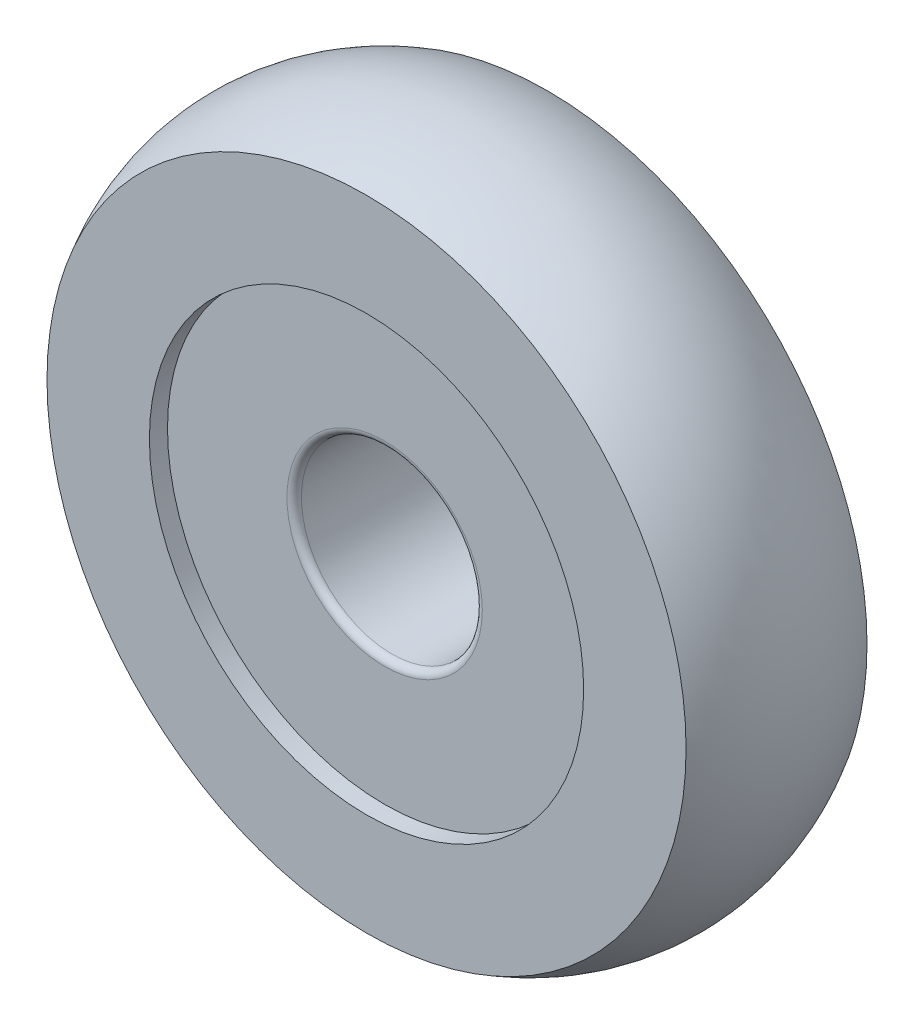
ISO-10303-21;
HEADER;
FILE_DESCRIPTION(('STEP AP214'),'2;1');
FILE_NAME('part.step','',(''),(''),'','','');
FILE_SCHEMA(('AUTOMOTIVE_DESIGN { 1 0 10303 214 1 1 1 1 }'));
ENDSEC;
DATA;
#1=APPLICATION_CONTEXT('core data for automotive mechanical design processes');
#2=APPLICATION_PROTOCOL_DEFINITION('international standard','automotive_design',2000,#1);
#3=PRODUCT_CONTEXT('',#1,'mechanical');
#4=PRODUCT('Part','Part','',(#3));
#5=PRODUCT_RELATED_PRODUCT_CATEGORY('part','',(#4));
#6=PRODUCT_DEFINITION_FORMATION('','',#4);
#7=PRODUCT_DEFINITION_CONTEXT('part definition',#1,'design');
#8=PRODUCT_DEFINITION('design','',#6,#7);
#9=PRODUCT_DEFINITION_SHAPE('','',#8);
#10=(LENGTH_UNIT() NAMED_UNIT(*) SI_UNIT(.MILLI.,.METRE.));
#11=(NAMED_UNIT(*) PLANE_ANGLE_UNIT() SI_UNIT($,.RADIAN.));
#12=(NAMED_UNIT(*) SI_UNIT($,.STERADIAN.) SOLID_ANGLE_UNIT());
#13=UNCERTAINTY_MEASURE_WITH_UNIT(LENGTH_MEASURE(1.E-05),#10,'distance_accuracy_value','');
#14=(GEOMETRIC_REPRESENTATION_CONTEXT(3) GLOBAL_UNCERTAINTY_ASSIGNED_CONTEXT((#13)) GLOBAL_UNIT_ASSIGNED_CONTEXT((#10,
#11,#12)) REPRESENTATION_CONTEXT('',''));
#15=CARTESIAN_POINT('',(0.,0.,0.));
#16=DIRECTION('',(0.,0.,1.));
#17=DIRECTION('',(1.,0.,0.));
#18=AXIS2_PLACEMENT_3D('',#15,#16,#17);
#19=CARTESIAN_POINT('',(0.,8.830127,-2.5));
#20=DIRECTION('',(0.,0.,1.));
#21=DIRECTION('',(1.,0.,0.));
#22=AXIS2_PLACEMENT_3D('',#19,#20,#21);
#23=PLANE('',#22);
#24=CARTESIAN_POINT('',(0.,0.,-2.5));
#25=DIRECTION('',(0.,0.,-1.));
#26=DIRECTION('',(-1.,0.,0.));
#27=AXIS2_PLACEMENT_3D('',#24,#25,#26);
#28=CIRCLE('',#27,8.83012701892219);
#29=CARTESIAN_POINT('',(-8.83012701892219,0.,-2.5));
#30=VERTEX_POINT('',#29);
#31=EDGE_CURVE('E44',#30,#30,#28,.T.);
#32=ORIENTED_EDGE('',*,*,#31,.T.);
#33=EDGE_LOOP('',(#32));
#34=FACE_BOUND('',#33,.T.);
#35=CARTESIAN_POINT('',(0.,0.,-2.5));
#36=DIRECTION('',(0.,0.,1.));
#37=DIRECTION('',(1.,0.,0.));
#38=AXIS2_PLACEMENT_3D('',#35,#36,#37);
#39=CIRCLE('',#38,6.);
#40=CARTESIAN_POINT('',(6.,0.,-2.5));
#41=VERTEX_POINT('',#40);
#42=EDGE_CURVE('E32',#41,#41,#39,.T.);
#43=ORIENTED_EDGE('',*,*,#42,.T.);
#44=EDGE_LOOP('',(#43));
#45=FACE_BOUND('',#44,.T.);
#46=ADVANCED_FACE('F12',(#34,#45),#23,.F.);
#47=CARTESIAN_POINT('',(0.,8.830127,2.5));
#48=DIRECTION('',(0.,0.,-1.));
#49=DIRECTION('',(-1.,0.,0.));
#50=AXIS2_PLACEMENT_3D('',#47,#48,#49);
#51=PLANE('',#50);
#52=CARTESIAN_POINT('',(0.,0.,2.5));
#53=DIRECTION('',(0.,0.,-1.));
#54=DIRECTION('',(-1.,0.,0.));
#55=AXIS2_PLACEMENT_3D('',#52,#53,#54);
#56=CIRCLE('',#55,8.83012701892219);
#57=CARTESIAN_POINT('',(-8.83012701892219,0.,2.5));
#58=VERTEX_POINT('',#57);
#59=EDGE_CURVE('E47',#58,#58,#56,.T.);
#60=ORIENTED_EDGE('',*,*,#59,.F.);
#61=EDGE_LOOP('',(#60));
#62=FACE_BOUND('',#61,.T.);
#63=CARTESIAN_POINT('',(0.,0.,2.5));
#64=DIRECTION('',(0.,0.,1.));
#65=DIRECTION('',(1.,0.,0.));
#66=AXIS2_PLACEMENT_3D('',#63,#64,#65);
#67=CIRCLE('',#66,6.);
#68=CARTESIAN_POINT('',(6.,0.,2.5));
#69=VERTEX_POINT('',#68);
#70=EDGE_CURVE('E35',#69,#69,#67,.T.);
#71=ORIENTED_EDGE('',*,*,#70,.F.);
#72=EDGE_LOOP('',(#71));
#73=FACE_BOUND('',#72,.T.);
#74=ADVANCED_FACE('F54',(#62,#73),#51,.F.);
#75=CARTESIAN_POINT('',(0.,0.,1.80000000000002));
#76=DIRECTION('',(0.,0.,1.));
#77=DIRECTION('',(1.,0.,0.));
#78=AXIS2_PLACEMENT_3D('',#75,#76,#77);
#79=TOROIDAL_SURFACE('',#78,2.7,0.199999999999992);
#80=CARTESIAN_POINT('',(0.,0.,1.80000000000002));
#81=DIRECTION('',(0.,0.,1.));
#82=DIRECTION('',(1.,0.,0.));
#83=AXIS2_PLACEMENT_3D('',#80,#81,#82);
#84=CIRCLE('',#83,2.5);
#85=CARTESIAN_POINT('',(2.5,0.,1.80000000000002));
#86=VERTEX_POINT('',#85);
#87=EDGE_CURVE('E8',#86,#86,#84,.T.);
#88=ORIENTED_EDGE('',*,*,#87,.F.);
#89=EDGE_LOOP('',(#88));
#90=FACE_BOUND('',#89,.T.);
#91=CARTESIAN_POINT('',(0.,0.,2.));
#92=DIRECTION('',(0.,0.,1.));
#93=DIRECTION('',(1.,0.,0.));
#94=AXIS2_PLACEMENT_3D('',#91,#92,#93);
#95=CIRCLE('',#94,2.7);
#96=CARTESIAN_POINT('',(2.7,0.,2.));
#97=VERTEX_POINT('',#96);
#98=EDGE_CURVE('E41',#97,#97,#95,.T.);
#99=ORIENTED_EDGE('',*,*,#98,.T.);
#100=EDGE_LOOP('',(#99));
#101=FACE_BOUND('',#100,.T.);
#102=ADVANCED_FACE('F14',(#90,#101),#79,.T.);
#103=CARTESIAN_POINT('',(0.,0.,5.5));
#104=DIRECTION('',(0.,0.,1.));
#105=DIRECTION('',(1.,0.,0.));
#106=AXIS2_PLACEMENT_3D('',#103,#104,#105);
#107=CYLINDRICAL_SURFACE('',#106,2.5);
#108=CARTESIAN_POINT('',(0.,0.,-1.8));
#109=DIRECTION('',(0.,0.,1.));
#110=DIRECTION('',(1.,0.,0.));
#111=AXIS2_PLACEMENT_3D('',#108,#109,#110);
#112=CIRCLE('',#111,2.5);
#113=CARTESIAN_POINT('',(2.5,0.,-1.8));
#114=VERTEX_POINT('',#113);
#115=EDGE_CURVE('E19',#114,#114,#112,.T.);
#116=ORIENTED_EDGE('',*,*,#115,.F.);
#117=EDGE_LOOP('',(#116));
#118=FACE_BOUND('',#117,.T.);
#119=ORIENTED_EDGE('',*,*,#87,.T.);
#120=EDGE_LOOP('',(#119));
#121=FACE_BOUND('',#120,.T.);
#122=ADVANCED_FACE('F89',(#118,#121),#107,.F.);
#123=CARTESIAN_POINT('',(0.,0.,-1.8));
#124=DIRECTION('',(0.,0.,1.));
#125=DIRECTION('',(1.,0.,0.));
#126=AXIS2_PLACEMENT_3D('',#123,#124,#125);
#127=TOROIDAL_SURFACE('',#126,2.7,0.200000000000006);
#128=CARTESIAN_POINT('',(0.,0.,-2.));
#129=DIRECTION('',(0.,0.,1.));
#130=DIRECTION('',(1.,0.,0.));
#131=AXIS2_PLACEMENT_3D('',#128,#129,#130);
#132=CIRCLE('',#131,2.7);
#133=CARTESIAN_POINT('',(2.7,0.,-2.));
#134=VERTEX_POINT('',#133);
#135=EDGE_CURVE('E23',#134,#134,#132,.T.);
#136=ORIENTED_EDGE('',*,*,#135,.F.);
#137=EDGE_LOOP('',(#136));
#138=FACE_BOUND('',#137,.T.);
#139=ORIENTED_EDGE('',*,*,#115,.T.);
#140=EDGE_LOOP('',(#139));
#141=FACE_BOUND('',#140,.T.);
#142=ADVANCED_FACE('F86',(#138,#141),#127,.T.);
#143=CARTESIAN_POINT('',(0.,2.7,-2.));
#144=DIRECTION('',(0.,0.,1.));
#145=DIRECTION('',(1.,0.,0.));
#146=AXIS2_PLACEMENT_3D('',#143,#144,#145);
#147=PLANE('',#146);
#148=CARTESIAN_POINT('',(0.,0.,-2.));
#149=DIRECTION('',(0.,0.,1.));
#150=DIRECTION('',(1.,0.,0.));
#151=AXIS2_PLACEMENT_3D('',#148,#149,#150);
#152=CIRCLE('',#151,6.);
#153=CARTESIAN_POINT('',(6.,0.,-2.));
#154=VERTEX_POINT('',#153);
#155=EDGE_CURVE('E27',#154,#154,#152,.T.);
#156=ORIENTED_EDGE('',*,*,#155,.F.);
#157=EDGE_LOOP('',(#156));
#158=FACE_BOUND('',#157,.T.);
#159=ORIENTED_EDGE('',*,*,#135,.T.);
#160=EDGE_LOOP('',(#159));
#161=FACE_BOUND('',#160,.T.);
#162=ADVANCED_FACE('F73',(#158,#161),#147,.F.);
#163=CARTESIAN_POINT('',(0.,0.,5.5));
#164=DIRECTION('',(0.,0.,1.));
#165=DIRECTION('',(1.,0.,0.));
#166=AXIS2_PLACEMENT_3D('',#163,#164,#165);
#167=CYLINDRICAL_SURFACE('',#166,6.);
#168=ORIENTED_EDGE('',*,*,#42,.F.);
#169=EDGE_LOOP('',(#168));
#170=FACE_BOUND('',#169,.T.);
#171=ORIENTED_EDGE('',*,*,#155,.T.);
#172=EDGE_LOOP('',(#171));
#173=FACE_BOUND('',#172,.T.);
#174=ADVANCED_FACE('F63',(#170,#173),#167,.F.);
#175=CARTESIAN_POINT('',(0.,0.,5.5));
#176=DIRECTION('',(0.,0.,1.));
#177=DIRECTION('',(1.,0.,0.));
#178=AXIS2_PLACEMENT_3D('',#175,#176,#177);
#179=CYLINDRICAL_SURFACE('',#178,6.);
#180=CARTESIAN_POINT('',(0.,0.,2.));
#181=DIRECTION('',(0.,0.,1.));
#182=DIRECTION('',(1.,0.,0.));
#183=AXIS2_PLACEMENT_3D('',#180,#181,#182);
#184=CIRCLE('',#183,6.);
#185=CARTESIAN_POINT('',(6.,0.,2.));
#186=VERTEX_POINT('',#185);
#187=EDGE_CURVE('E38',#186,#186,#184,.T.);
#188=ORIENTED_EDGE('',*,*,#187,.F.);
#189=EDGE_LOOP('',(#188));
#190=FACE_BOUND('',#189,.T.);
#191=ORIENTED_EDGE('',*,*,#70,.T.);
#192=EDGE_LOOP('',(#191));
#193=FACE_BOUND('',#192,.T.);
#194=ADVANCED_FACE('F60',(#190,#193),#179,.F.);
#195=CARTESIAN_POINT('',(0.,6.,2.));
#196=DIRECTION('',(0.,0.,-1.));
#197=DIRECTION('',(-1.,0.,0.));
#198=AXIS2_PLACEMENT_3D('',#195,#196,#197);
#199=PLANE('',#198);
#200=ORIENTED_EDGE('',*,*,#98,.F.);
#201=EDGE_LOOP('',(#200));
#202=FACE_BOUND('',#201,.T.);
#203=ORIENTED_EDGE('',*,*,#187,.T.);
#204=EDGE_LOOP('',(#203));
#205=FACE_BOUND('',#204,.T.);
#206=ADVANCED_FACE('F62',(#202,#205),#199,.F.);
#207=CARTESIAN_POINT('',(0.,0.,0.));
#208=DIRECTION('',(0.,0.,-1.));
#209=DIRECTION('',(-1.,0.,0.));
#210=AXIS2_PLACEMENT_3D('',#207,#208,#209);
#211=DEGENERATE_TOROIDAL_SURFACE('',#210,4.5,5.,.T.);
#212=ORIENTED_EDGE('',*,*,#59,.T.);
#213=EDGE_LOOP('',(#212));
#214=FACE_BOUND('',#213,.T.);
#215=ORIENTED_EDGE('',*,*,#31,.F.);
#216=EDGE_LOOP('',(#215));
#217=FACE_BOUND('',#216,.T.);
#218=ADVANCED_FACE('F51',(#214,#217),#211,.T.);
#219=CLOSED_SHELL('',(#46,#74,#102,#122,#142,#162,#174,#194,#206,#218));
#220=MANIFOLD_SOLID_BREP('B1',#219);
#221=ADVANCED_BREP_SHAPE_REPRESENTATION('',(#18,#220),#14);
#222=SHAPE_DEFINITION_REPRESENTATION(#9,#221);
ENDSEC;
END-ISO-10303-21;
